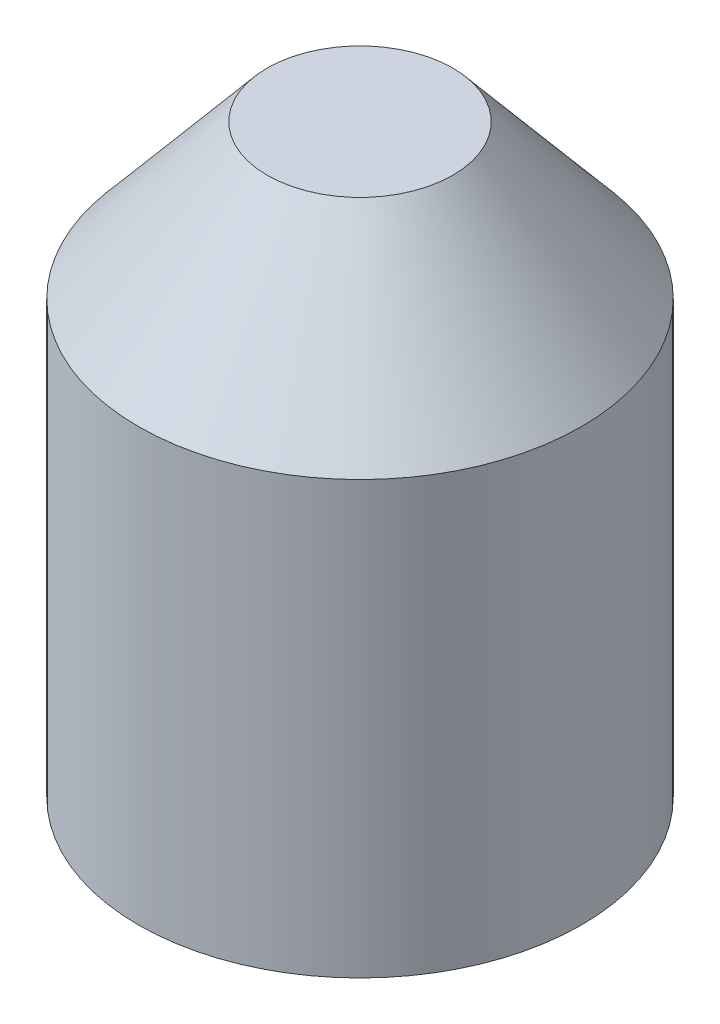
ISO-10303-21;
HEADER;
FILE_DESCRIPTION(('STEP AP214'),'2;1');
FILE_NAME('part.step','',(''),(''),'','','');
FILE_SCHEMA(('AUTOMOTIVE_DESIGN { 1 0 10303 214 1 1 1 1 }'));
ENDSEC;
DATA;
#1=APPLICATION_CONTEXT('core data for automotive mechanical design processes');
#2=APPLICATION_PROTOCOL_DEFINITION('international standard','automotive_design',2000,#1);
#3=PRODUCT_CONTEXT('',#1,'mechanical');
#4=PRODUCT('Part','Part','',(#3));
#5=PRODUCT_RELATED_PRODUCT_CATEGORY('part','',(#4));
#6=PRODUCT_DEFINITION_FORMATION('','',#4);
#7=PRODUCT_DEFINITION_CONTEXT('part definition',#1,'design');
#8=PRODUCT_DEFINITION('design','',#6,#7);
#9=PRODUCT_DEFINITION_SHAPE('','',#8);
#10=(LENGTH_UNIT() NAMED_UNIT(*) SI_UNIT(.MILLI.,.METRE.));
#11=(NAMED_UNIT(*) PLANE_ANGLE_UNIT() SI_UNIT($,.RADIAN.));
#12=(NAMED_UNIT(*) SI_UNIT($,.STERADIAN.) SOLID_ANGLE_UNIT());
#13=UNCERTAINTY_MEASURE_WITH_UNIT(LENGTH_MEASURE(1.E-05),#10,'distance_accuracy_value','');
#14=(GEOMETRIC_REPRESENTATION_CONTEXT(3) GLOBAL_UNCERTAINTY_ASSIGNED_CONTEXT((#13)) GLOBAL_UNIT_ASSIGNED_CONTEXT((#10,
#11,#12)) REPRESENTATION_CONTEXT('',''));
#15=CARTESIAN_POINT('',(0.,0.,0.));
#16=DIRECTION('',(0.,0.,1.));
#17=DIRECTION('',(1.,0.,0.));
#18=AXIS2_PLACEMENT_3D('',#15,#16,#17);
#19=CARTESIAN_POINT('',(0.,81.0775030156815,0.));
#20=DIRECTION('',(0.,1.,0.));
#21=DIRECTION('',(0.,0.,1.));
#22=AXIS2_PLACEMENT_3D('',#19,#20,#21);
#23=PLANE('',#22);
#24=CARTESIAN_POINT('',(0.,81.077503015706,0.));
#25=DIRECTION('',(0.,-1.,0.));
#26=DIRECTION('',(0.,0.,-1.));
#27=AXIS2_PLACEMENT_3D('',#24,#25,#26);
#28=CIRCLE('',#27,0.817215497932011);
#29=CARTESIAN_POINT('',(0.,81.077503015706,-0.817215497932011));
#30=VERTEX_POINT('',#29);
#31=EDGE_CURVE('E17',#30,#30,#28,.T.);
#32=ORIENTED_EDGE('',*,*,#31,.F.);
#33=EDGE_LOOP('',(#32));
#34=FACE_BOUND('',#33,.T.);
#35=ADVANCED_FACE('F14',(#34),#23,.T.);
#36=CARTESIAN_POINT('',(0.,79.7275030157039,0.));
#37=DIRECTION('',(0.,-1.,0.));
#38=DIRECTION('',(0.,0.,-1.));
#39=AXIS2_PLACEMENT_3D('',#36,#37,#38);
#40=CONICAL_SURFACE('',#39,1.9500000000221,0.698131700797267);
#41=CARTESIAN_POINT('',(0.,79.7275030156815,0.));
#42=DIRECTION('',(0.,-1.,0.));
#43=DIRECTION('',(0.,0.,-1.));
#44=AXIS2_PLACEMENT_3D('',#41,#42,#43);
#45=CIRCLE('',#44,1.95);
#46=CARTESIAN_POINT('',(0.,79.7275030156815,-1.95));
#47=VERTEX_POINT('',#46);
#48=EDGE_CURVE('E21',#47,#47,#45,.T.);
#49=ORIENTED_EDGE('',*,*,#48,.F.);
#50=EDGE_LOOP('',(#49));
#51=FACE_BOUND('',#50,.T.);
#52=ORIENTED_EDGE('',*,*,#31,.T.);
#53=EDGE_LOOP('',(#52));
#54=FACE_BOUND('',#53,.T.);
#55=ADVANCED_FACE('F33',(#51,#54),#40,.T.);
#56=CARTESIAN_POINT('',(0.,75.9275030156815,0.));
#57=DIRECTION('',(0.,1.,0.));
#58=DIRECTION('',(0.,0.,1.));
#59=AXIS2_PLACEMENT_3D('',#56,#57,#58);
#60=PLANE('',#59);
#61=CARTESIAN_POINT('',(0.,75.9275030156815,0.));
#62=DIRECTION('',(0.,-1.,0.));
#63=DIRECTION('',(0.,0.,-1.));
#64=AXIS2_PLACEMENT_3D('',#61,#62,#63);
#65=CIRCLE('',#64,1.95);
#66=CARTESIAN_POINT('',(0.,75.9275030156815,-1.95));
#67=VERTEX_POINT('',#66);
#68=EDGE_CURVE('E10',#67,#67,#65,.F.);
#69=ORIENTED_EDGE('',*,*,#68,.F.);
#70=EDGE_LOOP('',(#69));
#71=FACE_BOUND('',#70,.T.);
#72=ADVANCED_FACE('F40',(#71),#60,.F.);
#73=CARTESIAN_POINT('',(0.,79.7275030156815,0.));
#74=DIRECTION('',(0.,-1.,0.));
#75=DIRECTION('',(0.,0.,-1.));
#76=AXIS2_PLACEMENT_3D('',#73,#74,#75);
#77=CYLINDRICAL_SURFACE('',#76,1.95);
#78=ORIENTED_EDGE('',*,*,#68,.T.);
#79=EDGE_LOOP('',(#78));
#80=FACE_BOUND('',#79,.T.);
#81=ORIENTED_EDGE('',*,*,#48,.T.);
#82=EDGE_LOOP('',(#81));
#83=FACE_BOUND('',#82,.T.);
#84=ADVANCED_FACE('F42',(#80,#83),#77,.T.);
#85=CLOSED_SHELL('',(#35,#55,#72,#84));
#86=MANIFOLD_SOLID_BREP('B1',#85);
#87=ADVANCED_BREP_SHAPE_REPRESENTATION('',(#18,#86),#14);
#88=SHAPE_DEFINITION_REPRESENTATION(#9,#87);
ENDSEC;
END-ISO-10303-21;
